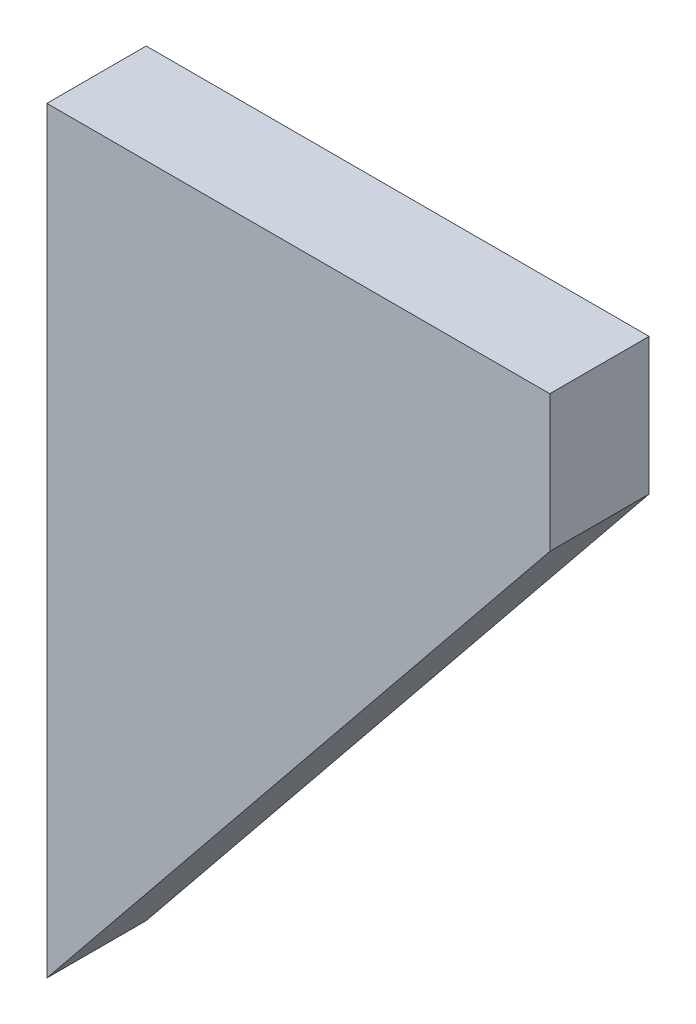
from build123d import *

# Parameters (mm, degrees)
EXTRUSION1_DEPTH = 8


with BuildPart() as part:
    # Esquisse1 → Extrusion1 (new body)
    with BuildSketch(Plane.XY):
        Polygon((0, 0), (0, 61), (40.5, 61), (40.5, 50), align=None)
    extrude(amount=EXTRUSION1_DEPTH)


solid = part.part
